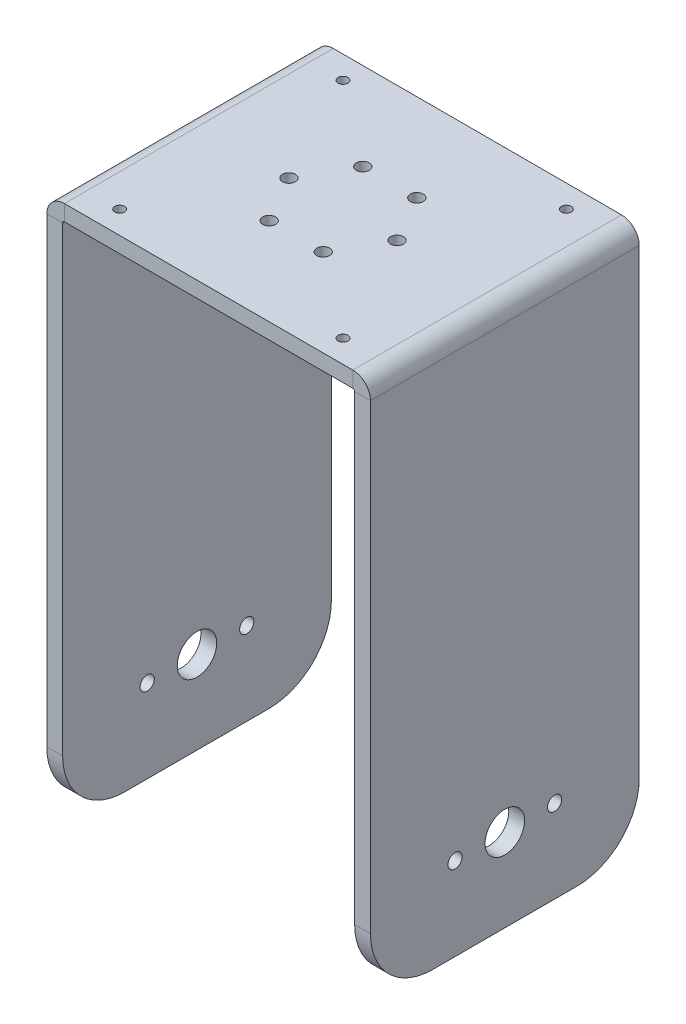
ISO-10303-21;
HEADER;
FILE_DESCRIPTION(('STEP AP214'),'2;1');
FILE_NAME('part.step','',(''),(''),'','','');
FILE_SCHEMA(('AUTOMOTIVE_DESIGN { 1 0 10303 214 1 1 1 1 }'));
ENDSEC;
DATA;
#1=APPLICATION_CONTEXT('core data for automotive mechanical design processes');
#2=APPLICATION_PROTOCOL_DEFINITION('international standard','automotive_design',2000,#1);
#3=PRODUCT_CONTEXT('',#1,'mechanical');
#4=PRODUCT('Part','Part','',(#3));
#5=PRODUCT_RELATED_PRODUCT_CATEGORY('part','',(#4));
#6=PRODUCT_DEFINITION_FORMATION('','',#4);
#7=PRODUCT_DEFINITION_CONTEXT('part definition',#1,'design');
#8=PRODUCT_DEFINITION('design','',#6,#7);
#9=PRODUCT_DEFINITION_SHAPE('','',#8);
#10=(LENGTH_UNIT() NAMED_UNIT(*) SI_UNIT(.MILLI.,.METRE.));
#11=(NAMED_UNIT(*) PLANE_ANGLE_UNIT() SI_UNIT($,.RADIAN.));
#12=(NAMED_UNIT(*) SI_UNIT($,.STERADIAN.) SOLID_ANGLE_UNIT());
#13=UNCERTAINTY_MEASURE_WITH_UNIT(LENGTH_MEASURE(1.E-05),#10,'distance_accuracy_value','');
#14=(GEOMETRIC_REPRESENTATION_CONTEXT(3) GLOBAL_UNCERTAINTY_ASSIGNED_CONTEXT((#13)) GLOBAL_UNIT_ASSIGNED_CONTEXT((#10,
#11,#12)) REPRESENTATION_CONTEXT('',''));
#15=CARTESIAN_POINT('',(0.,0.,0.));
#16=DIRECTION('',(0.,0.,1.));
#17=DIRECTION('',(1.,0.,0.));
#18=AXIS2_PLACEMENT_3D('',#15,#16,#17);
#19=CARTESIAN_POINT('',(-65.,-6.35,-53.975));
#20=DIRECTION('',(0.,0.,1.));
#21=DIRECTION('',(1.,0.,0.));
#22=AXIS2_PLACEMENT_3D('',#19,#20,#21);
#23=PLANE('',#22);
#24=DIRECTION('',(0.,1.,0.));
#25=VECTOR('',#24,1.);
#26=CARTESIAN_POINT('',(-57.9134,-6.35,-53.975));
#27=LINE('',#26,#25);
#28=CARTESIAN_POINT('',(-57.9134,-6.35,-53.975));
#29=VERTEX_POINT('',#28);
#30=CARTESIAN_POINT('',(-57.9134,0.,-53.975));
#31=VERTEX_POINT('',#30);
#32=EDGE_CURVE('E288',#29,#31,#27,.T.);
#33=ORIENTED_EDGE('',*,*,#32,.T.);
#34=DIRECTION('',(1.,0.,0.));
#35=VECTOR('',#34,1.);
#36=CARTESIAN_POINT('',(-65.,0.,-53.975));
#37=LINE('',#36,#35);
#38=CARTESIAN_POINT('',(57.9134,0.,-53.975));
#39=VERTEX_POINT('',#38);
#40=EDGE_CURVE('E371',#31,#39,#37,.T.);
#41=ORIENTED_EDGE('',*,*,#40,.T.);
#42=DIRECTION('',(0.,1.,0.));
#43=VECTOR('',#42,1.);
#44=CARTESIAN_POINT('',(57.9134,-6.35,-53.975));
#45=LINE('',#44,#43);
#46=CARTESIAN_POINT('',(57.9134,-6.35,-53.975));
#47=VERTEX_POINT('',#46);
#48=EDGE_CURVE('E362',#47,#39,#45,.T.);
#49=ORIENTED_EDGE('',*,*,#48,.F.);
#50=DIRECTION('',(1.,0.,0.));
#51=VECTOR('',#50,1.);
#52=CARTESIAN_POINT('',(-65.,-6.35,-53.975));
#53=LINE('',#52,#51);
#54=EDGE_CURVE('E370',#29,#47,#53,.T.);
#55=ORIENTED_EDGE('',*,*,#54,.F.);
#56=EDGE_LOOP('',(#33,#41,#49,#55));
#57=FACE_BOUND('',#56,.T.);
#58=ADVANCED_FACE('F97',(#57),#23,.F.);
#59=CARTESIAN_POINT('',(0.,-6.35,0.));
#60=DIRECTION('',(0.,-1.,0.));
#61=DIRECTION('',(0.,0.,-1.));
#62=AXIS2_PLACEMENT_3D('',#59,#60,#61);
#63=PLANE('',#62);
#64=CARTESIAN_POINT('',(-44.8450000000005,-6.34999999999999,44.8449999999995));
#65=DIRECTION('',(0.,-1.,0.));
#66=DIRECTION('',(0.,0.,-1.));
#67=AXIS2_PLACEMENT_3D('',#64,#65,#66);
#68=CIRCLE('',#67,1.985);
#69=CARTESIAN_POINT('',(-44.8450000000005,-6.34999999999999,42.8599999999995));
#70=VERTEX_POINT('',#69);
#71=EDGE_CURVE('E919',#70,#70,#68,.T.);
#72=ORIENTED_EDGE('',*,*,#71,.F.);
#73=EDGE_LOOP('',(#72));
#74=FACE_BOUND('',#73,.T.);
#75=CARTESIAN_POINT('',(44.8449999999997,-6.34999999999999,44.8450000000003));
#76=DIRECTION('',(0.,-1.,0.));
#77=DIRECTION('',(0.,0.,-1.));
#78=AXIS2_PLACEMENT_3D('',#75,#76,#77);
#79=CIRCLE('',#78,1.985);
#80=CARTESIAN_POINT('',(44.8449999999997,-6.34999999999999,42.8600000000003));
#81=VERTEX_POINT('',#80);
#82=EDGE_CURVE('E938',#81,#81,#79,.T.);
#83=ORIENTED_EDGE('',*,*,#82,.F.);
#84=EDGE_LOOP('',(#83));
#85=FACE_BOUND('',#84,.T.);
#86=CARTESIAN_POINT('',(44.8450000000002,-6.34999999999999,-44.8449999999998));
#87=DIRECTION('',(0.,-1.,0.));
#88=DIRECTION('',(0.,0.,-1.));
#89=AXIS2_PLACEMENT_3D('',#86,#87,#88);
#90=CIRCLE('',#89,1.985);
#91=CARTESIAN_POINT('',(44.8450000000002,-6.34999999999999,-46.8299999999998));
#92=VERTEX_POINT('',#91);
#93=EDGE_CURVE('E935',#92,#92,#90,.T.);
#94=ORIENTED_EDGE('',*,*,#93,.F.);
#95=EDGE_LOOP('',(#94));
#96=FACE_BOUND('',#95,.T.);
#97=CARTESIAN_POINT('',(-44.845,-6.34999999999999,-44.845));
#98=DIRECTION('',(0.,-1.,0.));
#99=DIRECTION('',(0.,0.,-1.));
#100=AXIS2_PLACEMENT_3D('',#97,#98,#99);
#101=CIRCLE('',#100,1.985);
#102=CARTESIAN_POINT('',(-44.845,-6.34999999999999,-46.83));
#103=VERTEX_POINT('',#102);
#104=EDGE_CURVE('E932',#103,#103,#101,.T.);
#105=ORIENTED_EDGE('',*,*,#104,.F.);
#106=EDGE_LOOP('',(#105));
#107=FACE_BOUND('',#106,.T.);
#108=CARTESIAN_POINT('',(-21.7,-6.34999999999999,0.));
#109=DIRECTION('',(0.,-1.,0.));
#110=DIRECTION('',(0.,0.,-1.));
#111=AXIS2_PLACEMENT_3D('',#108,#109,#110);
#112=CIRCLE('',#111,2.6);
#113=CARTESIAN_POINT('',(-21.7,-6.34999999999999,-2.59999999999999));
#114=VERTEX_POINT('',#113);
#115=EDGE_CURVE('E254',#114,#114,#112,.T.);
#116=ORIENTED_EDGE('',*,*,#115,.F.);
#117=EDGE_LOOP('',(#116));
#118=FACE_BOUND('',#117,.T.);
#119=CARTESIAN_POINT('',(-10.8500000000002,-6.34999999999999,18.7927512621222));
#120=DIRECTION('',(0.,-1.,0.));
#121=DIRECTION('',(0.,0.,-1.));
#122=AXIS2_PLACEMENT_3D('',#119,#120,#121);
#123=CIRCLE('',#122,2.6);
#124=CARTESIAN_POINT('',(-10.8500000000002,-6.34999999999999,16.1927512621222));
#125=VERTEX_POINT('',#124);
#126=EDGE_CURVE('E970',#125,#125,#123,.T.);
#127=ORIENTED_EDGE('',*,*,#126,.F.);
#128=EDGE_LOOP('',(#127));
#129=FACE_BOUND('',#128,.T.);
#130=CARTESIAN_POINT('',(10.8499999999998,-6.34999999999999,18.7927512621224));
#131=DIRECTION('',(0.,-1.,0.));
#132=DIRECTION('',(0.,0.,-1.));
#133=AXIS2_PLACEMENT_3D('',#130,#131,#132);
#134=CIRCLE('',#133,2.6);
#135=CARTESIAN_POINT('',(10.8499999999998,-6.34999999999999,16.1927512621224));
#136=VERTEX_POINT('',#135);
#137=EDGE_CURVE('E968',#136,#136,#134,.T.);
#138=ORIENTED_EDGE('',*,*,#137,.F.);
#139=EDGE_LOOP('',(#138));
#140=FACE_BOUND('',#139,.T.);
#141=CARTESIAN_POINT('',(21.7,-6.34999999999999,1.37652502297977E-13));
#142=DIRECTION('',(0.,-1.,0.));
#143=DIRECTION('',(0.,0.,-1.));
#144=AXIS2_PLACEMENT_3D('',#141,#142,#143);
#145=CIRCLE('',#144,2.6);
#146=CARTESIAN_POINT('',(21.7,-6.34999999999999,-2.59999999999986));
#147=VERTEX_POINT('',#146);
#148=EDGE_CURVE('E965',#147,#147,#145,.T.);
#149=ORIENTED_EDGE('',*,*,#148,.F.);
#150=EDGE_LOOP('',(#149));
#151=FACE_BOUND('',#150,.T.);
#152=CARTESIAN_POINT('',(10.8500000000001,-6.34999999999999,-18.7927512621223));
#153=DIRECTION('',(0.,-1.,0.));
#154=DIRECTION('',(0.,0.,-1.));
#155=AXIS2_PLACEMENT_3D('',#152,#153,#154);
#156=CIRCLE('',#155,2.6);
#157=CARTESIAN_POINT('',(10.8500000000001,-6.34999999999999,-21.3927512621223));
#158=VERTEX_POINT('',#157);
#159=EDGE_CURVE('E962',#158,#158,#156,.T.);
#160=ORIENTED_EDGE('',*,*,#159,.F.);
#161=EDGE_LOOP('',(#160));
#162=FACE_BOUND('',#161,.T.);
#163=CARTESIAN_POINT('',(-10.85,-6.34999999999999,-18.7927512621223));
#164=DIRECTION('',(0.,-1.,0.));
#165=DIRECTION('',(0.,0.,-1.));
#166=AXIS2_PLACEMENT_3D('',#163,#164,#165);
#167=CIRCLE('',#166,2.6);
#168=CARTESIAN_POINT('',(-10.85,-6.34999999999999,-21.3927512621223));
#169=VERTEX_POINT('',#168);
#170=EDGE_CURVE('E946',#169,#169,#167,.T.);
#171=ORIENTED_EDGE('',*,*,#170,.F.);
#172=EDGE_LOOP('',(#171));
#173=FACE_BOUND('',#172,.T.);
#174=DIRECTION('',(1.,0.,0.));
#175=VECTOR('',#174,1.);
#176=CARTESIAN_POINT('',(-65.,-6.35,53.975));
#177=LINE('',#176,#175);
#178=CARTESIAN_POINT('',(-57.9134,-6.35,53.975));
#179=VERTEX_POINT('',#178);
#180=CARTESIAN_POINT('',(57.9134,-6.35,53.975));
#181=VERTEX_POINT('',#180);
#182=EDGE_CURVE('E368',#179,#181,#177,.T.);
#183=ORIENTED_EDGE('',*,*,#182,.F.);
#184=DIRECTION('',(0.,0.,-1.));
#185=VECTOR('',#184,1.);
#186=CARTESIAN_POINT('',(-57.9134,-6.35,-53.975));
#187=LINE('',#186,#185);
#188=EDGE_CURVE('E250',#29,#179,#187,.F.);
#189=ORIENTED_EDGE('',*,*,#188,.F.);
#190=ORIENTED_EDGE('',*,*,#54,.T.);
#191=DIRECTION('',(0.,0.,1.));
#192=VECTOR('',#191,1.);
#193=CARTESIAN_POINT('',(57.9134,-6.35,53.975));
#194=LINE('',#193,#192);
#195=EDGE_CURVE('E357',#181,#47,#194,.F.);
#196=ORIENTED_EDGE('',*,*,#195,.F.);
#197=EDGE_LOOP('',(#183,#189,#190,#196));
#198=FACE_BOUND('',#197,.T.);
#199=ADVANCED_FACE('F445',(#74,#85,#96,#107,#118,#129,#140,#151,#162,#173,#198),#63,.T.);
#200=CARTESIAN_POINT('',(0.,0.,0.));
#201=DIRECTION('',(0.,-1.,0.));
#202=DIRECTION('',(0.,0.,-1.));
#203=AXIS2_PLACEMENT_3D('',#200,#201,#202);
#204=PLANE('',#203);
#205=CARTESIAN_POINT('',(-44.8450000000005,0.,44.8449999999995));
#206=DIRECTION('',(0.,1.,0.));
#207=DIRECTION('',(0.,0.,1.));
#208=AXIS2_PLACEMENT_3D('',#205,#206,#207);
#209=CIRCLE('',#208,1.985);
#210=CARTESIAN_POINT('',(-44.8450000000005,0.,46.8299999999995));
#211=VERTEX_POINT('',#210);
#212=EDGE_CURVE('E921',#211,#211,#209,.T.);
#213=ORIENTED_EDGE('',*,*,#212,.F.);
#214=EDGE_LOOP('',(#213));
#215=FACE_BOUND('',#214,.T.);
#216=CARTESIAN_POINT('',(44.8449999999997,0.,44.8450000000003));
#217=DIRECTION('',(0.,1.,0.));
#218=DIRECTION('',(0.,0.,1.));
#219=AXIS2_PLACEMENT_3D('',#216,#217,#218);
#220=CIRCLE('',#219,1.985);
#221=CARTESIAN_POINT('',(44.8449999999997,0.,46.8300000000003));
#222=VERTEX_POINT('',#221);
#223=EDGE_CURVE('E922',#222,#222,#220,.T.);
#224=ORIENTED_EDGE('',*,*,#223,.F.);
#225=EDGE_LOOP('',(#224));
#226=FACE_BOUND('',#225,.T.);
#227=CARTESIAN_POINT('',(44.8450000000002,0.,-44.8449999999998));
#228=DIRECTION('',(0.,1.,0.));
#229=DIRECTION('',(0.,0.,1.));
#230=AXIS2_PLACEMENT_3D('',#227,#228,#229);
#231=CIRCLE('',#230,1.985);
#232=CARTESIAN_POINT('',(44.8450000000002,0.,-42.8599999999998));
#233=VERTEX_POINT('',#232);
#234=EDGE_CURVE('E925',#233,#233,#231,.T.);
#235=ORIENTED_EDGE('',*,*,#234,.F.);
#236=EDGE_LOOP('',(#235));
#237=FACE_BOUND('',#236,.T.);
#238=CARTESIAN_POINT('',(-44.845,0.,-44.845));
#239=DIRECTION('',(0.,1.,0.));
#240=DIRECTION('',(0.,0.,1.));
#241=AXIS2_PLACEMENT_3D('',#238,#239,#240);
#242=CIRCLE('',#241,1.985);
#243=CARTESIAN_POINT('',(-44.845,0.,-42.86));
#244=VERTEX_POINT('',#243);
#245=EDGE_CURVE('E929',#244,#244,#242,.T.);
#246=ORIENTED_EDGE('',*,*,#245,.F.);
#247=EDGE_LOOP('',(#246));
#248=FACE_BOUND('',#247,.T.);
#249=CARTESIAN_POINT('',(-21.7,0.,0.));
#250=DIRECTION('',(0.,1.,0.));
#251=DIRECTION('',(0.,0.,1.));
#252=AXIS2_PLACEMENT_3D('',#249,#250,#251);
#253=CIRCLE('',#252,2.6);
#254=CARTESIAN_POINT('',(-21.7,0.,2.60000000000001));
#255=VERTEX_POINT('',#254);
#256=EDGE_CURVE('E943',#255,#255,#253,.T.);
#257=ORIENTED_EDGE('',*,*,#256,.F.);
#258=EDGE_LOOP('',(#257));
#259=FACE_BOUND('',#258,.T.);
#260=CARTESIAN_POINT('',(-10.8500000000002,0.,18.7927512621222));
#261=DIRECTION('',(0.,1.,0.));
#262=DIRECTION('',(0.,0.,1.));
#263=AXIS2_PLACEMENT_3D('',#260,#261,#262);
#264=CIRCLE('',#263,2.6);
#265=CARTESIAN_POINT('',(-10.8500000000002,0.,21.3927512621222));
#266=VERTEX_POINT('',#265);
#267=EDGE_CURVE('E942',#266,#266,#264,.T.);
#268=ORIENTED_EDGE('',*,*,#267,.F.);
#269=EDGE_LOOP('',(#268));
#270=FACE_BOUND('',#269,.T.);
#271=CARTESIAN_POINT('',(10.8499999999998,0.,18.7927512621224));
#272=DIRECTION('',(0.,1.,0.));
#273=DIRECTION('',(0.,0.,1.));
#274=AXIS2_PLACEMENT_3D('',#271,#272,#273);
#275=CIRCLE('',#274,2.6);
#276=CARTESIAN_POINT('',(10.8499999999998,0.,21.3927512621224));
#277=VERTEX_POINT('',#276);
#278=EDGE_CURVE('E950',#277,#277,#275,.T.);
#279=ORIENTED_EDGE('',*,*,#278,.F.);
#280=EDGE_LOOP('',(#279));
#281=FACE_BOUND('',#280,.T.);
#282=CARTESIAN_POINT('',(21.7,0.,1.37652502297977E-13));
#283=DIRECTION('',(0.,1.,0.));
#284=DIRECTION('',(0.,0.,1.));
#285=AXIS2_PLACEMENT_3D('',#282,#283,#284);
#286=CIRCLE('',#285,2.6);
#287=CARTESIAN_POINT('',(21.7,0.,2.60000000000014));
#288=VERTEX_POINT('',#287);
#289=EDGE_CURVE('E956',#288,#288,#286,.T.);
#290=ORIENTED_EDGE('',*,*,#289,.F.);
#291=EDGE_LOOP('',(#290));
#292=FACE_BOUND('',#291,.T.);
#293=CARTESIAN_POINT('',(10.8500000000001,0.,-18.7927512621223));
#294=DIRECTION('',(0.,1.,0.));
#295=DIRECTION('',(0.,0.,1.));
#296=AXIS2_PLACEMENT_3D('',#293,#294,#295);
#297=CIRCLE('',#296,2.6);
#298=CARTESIAN_POINT('',(10.8500000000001,0.,-16.1927512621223));
#299=VERTEX_POINT('',#298);
#300=EDGE_CURVE('E953',#299,#299,#297,.T.);
#301=ORIENTED_EDGE('',*,*,#300,.F.);
#302=EDGE_LOOP('',(#301));
#303=FACE_BOUND('',#302,.T.);
#304=CARTESIAN_POINT('',(-10.85,0.,-18.7927512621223));
#305=DIRECTION('',(0.,1.,0.));
#306=DIRECTION('',(0.,0.,1.));
#307=AXIS2_PLACEMENT_3D('',#304,#305,#306);
#308=CIRCLE('',#307,2.6);
#309=CARTESIAN_POINT('',(-10.85,0.,-16.1927512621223));
#310=VERTEX_POINT('',#309);
#311=EDGE_CURVE('E947',#310,#310,#308,.T.);
#312=ORIENTED_EDGE('',*,*,#311,.F.);
#313=EDGE_LOOP('',(#312));
#314=FACE_BOUND('',#313,.T.);
#315=DIRECTION('',(0.,0.,-1.));
#316=VECTOR('',#315,1.);
#317=CARTESIAN_POINT('',(-57.9134,0.,-53.975));
#318=LINE('',#317,#316);
#319=CARTESIAN_POINT('',(-57.9134,0.,53.975));
#320=VERTEX_POINT('',#319);
#321=EDGE_CURVE('E218',#31,#320,#318,.F.);
#322=ORIENTED_EDGE('',*,*,#321,.T.);
#323=DIRECTION('',(1.,0.,0.));
#324=VECTOR('',#323,1.);
#325=CARTESIAN_POINT('',(-65.,0.,53.975));
#326=LINE('',#325,#324);
#327=CARTESIAN_POINT('',(57.9134,0.,53.975));
#328=VERTEX_POINT('',#327);
#329=EDGE_CURVE('E365',#320,#328,#326,.T.);
#330=ORIENTED_EDGE('',*,*,#329,.T.);
#331=DIRECTION('',(0.,0.,1.));
#332=VECTOR('',#331,1.);
#333=CARTESIAN_POINT('',(57.9134,0.,53.975));
#334=LINE('',#333,#332);
#335=EDGE_CURVE('E344',#328,#39,#334,.F.);
#336=ORIENTED_EDGE('',*,*,#335,.T.);
#337=ORIENTED_EDGE('',*,*,#40,.F.);
#338=EDGE_LOOP('',(#322,#330,#336,#337));
#339=FACE_BOUND('',#338,.T.);
#340=ADVANCED_FACE('F450',(#215,#226,#237,#248,#259,#270,#281,#292,#303,#314,#339),#204,.F.);
#341=CARTESIAN_POINT('',(-65.,-6.35,53.975));
#342=DIRECTION('',(0.,0.,1.));
#343=DIRECTION('',(1.,0.,0.));
#344=AXIS2_PLACEMENT_3D('',#341,#342,#343);
#345=PLANE('',#344);
#346=DIRECTION('',(0.,1.,0.));
#347=VECTOR('',#346,1.);
#348=CARTESIAN_POINT('',(-57.9134,-6.35,53.975));
#349=LINE('',#348,#347);
#350=EDGE_CURVE('E294',#179,#320,#349,.T.);
#351=ORIENTED_EDGE('',*,*,#350,.F.);
#352=ORIENTED_EDGE('',*,*,#182,.T.);
#353=DIRECTION('',(0.,1.,0.));
#354=VECTOR('',#353,1.);
#355=CARTESIAN_POINT('',(57.9134,-6.35,53.975));
#356=LINE('',#355,#354);
#357=EDGE_CURVE('E351',#181,#328,#356,.T.);
#358=ORIENTED_EDGE('',*,*,#357,.T.);
#359=ORIENTED_EDGE('',*,*,#329,.F.);
#360=EDGE_LOOP('',(#351,#352,#358,#359));
#361=FACE_BOUND('',#360,.T.);
#362=ADVANCED_FACE('F448',(#361),#345,.T.);
#363=CARTESIAN_POINT('',(57.9134,-7.0866,-53.975));
#364=DIRECTION('',(0.,0.,-1.));
#365=DIRECTION('',(-1.,0.,0.));
#366=AXIS2_PLACEMENT_3D('',#363,#364,#365);
#367=PLANE('',#366);
#368=DIRECTION('',(1.,0.,0.));
#369=VECTOR('',#368,1.);
#370=CARTESIAN_POINT('',(65.,-7.08659999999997,-53.975));
#371=LINE('',#370,#369);
#372=CARTESIAN_POINT('',(58.65,-7.0866,-53.975));
#373=VERTEX_POINT('',#372);
#374=CARTESIAN_POINT('',(65.,-7.08659999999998,-53.9749999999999));
#375=VERTEX_POINT('',#374);
#376=EDGE_CURVE('E297',#373,#375,#371,.T.);
#377=ORIENTED_EDGE('',*,*,#376,.F.);
#378=CARTESIAN_POINT('',(57.9134,-7.0866,-53.975));
#379=DIRECTION('',(0.,0.,1.));
#380=DIRECTION('',(1.,0.,0.));
#381=AXIS2_PLACEMENT_3D('',#378,#379,#380);
#382=CIRCLE('',#381,0.736599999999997);
#383=EDGE_CURVE('E354',#47,#373,#382,.F.);
#384=ORIENTED_EDGE('',*,*,#383,.F.);
#385=ORIENTED_EDGE('',*,*,#48,.T.);
#386=CARTESIAN_POINT('',(57.9134,-7.0866,-53.9749999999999));
#387=DIRECTION('',(0.,0.,1.));
#388=DIRECTION('',(1.,0.,0.));
#389=AXIS2_PLACEMENT_3D('',#386,#387,#388);
#390=CIRCLE('',#389,7.0866);
#391=EDGE_CURVE('E347',#39,#375,#390,.F.);
#392=ORIENTED_EDGE('',*,*,#391,.T.);
#393=EDGE_LOOP('',(#377,#384,#385,#392));
#394=FACE_BOUND('',#393,.T.);
#395=ADVANCED_FACE('F434',(#394),#367,.T.);
#396=CARTESIAN_POINT('',(57.9134,-7.0866,53.975));
#397=DIRECTION('',(0.,0.,-1.));
#398=DIRECTION('',(-1.,0.,0.));
#399=AXIS2_PLACEMENT_3D('',#396,#397,#398);
#400=PLANE('',#399);
#401=CARTESIAN_POINT('',(57.9134,-7.0866,53.975));
#402=DIRECTION('',(0.,0.,1.));
#403=DIRECTION('',(1.,0.,0.));
#404=AXIS2_PLACEMENT_3D('',#401,#402,#403);
#405=CIRCLE('',#404,0.736599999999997);
#406=CARTESIAN_POINT('',(58.65,-7.0866,53.975));
#407=VERTEX_POINT('',#406);
#408=EDGE_CURVE('E301',#407,#181,#405,.T.);
#409=ORIENTED_EDGE('',*,*,#408,.F.);
#410=DIRECTION('',(1.,0.,0.));
#411=VECTOR('',#410,1.);
#412=CARTESIAN_POINT('',(58.65,-7.0866,53.975));
#413=LINE('',#412,#411);
#414=CARTESIAN_POINT('',(65.,-7.08659999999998,53.975));
#415=VERTEX_POINT('',#414);
#416=EDGE_CURVE('E336',#407,#415,#413,.T.);
#417=ORIENTED_EDGE('',*,*,#416,.T.);
#418=CARTESIAN_POINT('',(57.9134,-7.0866,53.975));
#419=DIRECTION('',(0.,0.,1.));
#420=DIRECTION('',(1.,0.,0.));
#421=AXIS2_PLACEMENT_3D('',#418,#419,#420);
#422=CIRCLE('',#421,7.0866);
#423=EDGE_CURVE('E348',#415,#328,#422,.T.);
#424=ORIENTED_EDGE('',*,*,#423,.T.);
#425=ORIENTED_EDGE('',*,*,#357,.F.);
#426=EDGE_LOOP('',(#409,#417,#424,#425));
#427=FACE_BOUND('',#426,.T.);
#428=ADVANCED_FACE('F427',(#427),#400,.F.);
#429=CARTESIAN_POINT('',(57.9134,-7.0866,53.975));
#430=DIRECTION('',(0.,0.,1.));
#431=DIRECTION('',(1.,0.,0.));
#432=AXIS2_PLACEMENT_3D('',#429,#430,#431);
#433=CYLINDRICAL_SURFACE('',#432,7.0866);
#434=ORIENTED_EDGE('',*,*,#335,.F.);
#435=ORIENTED_EDGE('',*,*,#423,.F.);
#436=DIRECTION('',(0.,0.,1.));
#437=VECTOR('',#436,1.);
#438=CARTESIAN_POINT('',(65.,-7.08659999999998,0.));
#439=LINE('',#438,#437);
#440=EDGE_CURVE('E333',#375,#415,#439,.T.);
#441=ORIENTED_EDGE('',*,*,#440,.F.);
#442=ORIENTED_EDGE('',*,*,#391,.F.);
#443=EDGE_LOOP('',(#434,#435,#441,#442));
#444=FACE_BOUND('',#443,.T.);
#445=ADVANCED_FACE('F432',(#444),#433,.T.);
#446=CARTESIAN_POINT('',(57.9134,-7.0866,53.975));
#447=DIRECTION('',(0.,0.,1.));
#448=DIRECTION('',(1.,0.,0.));
#449=AXIS2_PLACEMENT_3D('',#446,#447,#448);
#450=CYLINDRICAL_SURFACE('',#449,0.736599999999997);
#451=ORIENTED_EDGE('',*,*,#195,.T.);
#452=ORIENTED_EDGE('',*,*,#383,.T.);
#453=DIRECTION('',(0.,0.,-1.));
#454=VECTOR('',#453,1.);
#455=CARTESIAN_POINT('',(58.65,-7.0866,-53.975));
#456=LINE('',#455,#454);
#457=EDGE_CURVE('E339',#373,#407,#456,.F.);
#458=ORIENTED_EDGE('',*,*,#457,.T.);
#459=ORIENTED_EDGE('',*,*,#408,.T.);
#460=EDGE_LOOP('',(#451,#452,#458,#459));
#461=FACE_BOUND('',#460,.T.);
#462=ADVANCED_FACE('F442',(#461),#450,.F.);
#463=CARTESIAN_POINT('',(65.,-6.34999999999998,53.975));
#464=DIRECTION('',(0.,0.,1.));
#465=DIRECTION('',(1.,0.,0.));
#466=AXIS2_PLACEMENT_3D('',#463,#464,#465);
#467=PLANE('',#466);
#468=DIRECTION('',(0.,-1.,0.));
#469=VECTOR('',#468,1.);
#470=CARTESIAN_POINT('',(58.65,2.26435280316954E-13,53.975));
#471=LINE('',#470,#469);
#472=CARTESIAN_POINT('',(58.6500000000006,-192.4875,53.975));
#473=VERTEX_POINT('',#472);
#474=EDGE_CURVE('E307',#473,#407,#471,.F.);
#475=ORIENTED_EDGE('',*,*,#474,.F.);
#476=DIRECTION('',(-1.,0.,0.));
#477=VECTOR('',#476,1.);
#478=CARTESIAN_POINT('',(65.0000000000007,-192.4875,53.975));
#479=LINE('',#478,#477);
#480=CARTESIAN_POINT('',(65.0000000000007,-192.4875,53.975));
#481=VERTEX_POINT('',#480);
#482=EDGE_CURVE('E13',#473,#481,#479,.F.);
#483=ORIENTED_EDGE('',*,*,#482,.T.);
#484=DIRECTION('',(0.,1.,0.));
#485=VECTOR('',#484,1.);
#486=CARTESIAN_POINT('',(65.,-6.34999999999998,53.975));
#487=LINE('',#486,#485);
#488=EDGE_CURVE('E299',#481,#415,#487,.T.);
#489=ORIENTED_EDGE('',*,*,#488,.T.);
#490=ORIENTED_EDGE('',*,*,#416,.F.);
#491=EDGE_LOOP('',(#475,#483,#489,#490));
#492=FACE_BOUND('',#491,.T.);
#493=ADVANCED_FACE('F423',(#492),#467,.T.);
#494=CARTESIAN_POINT('',(65.0000000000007,-217.4875,-53.975));
#495=DIRECTION('',(0.,0.,-1.));
#496=DIRECTION('',(-1.,0.,0.));
#497=AXIS2_PLACEMENT_3D('',#494,#495,#496);
#498=PLANE('',#497);
#499=DIRECTION('',(0.,-1.,0.));
#500=VECTOR('',#499,1.);
#501=CARTESIAN_POINT('',(65.0000000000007,-217.4875,-53.975));
#502=LINE('',#501,#500);
#503=CARTESIAN_POINT('',(65.0000000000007,-192.4875,-53.975));
#504=VERTEX_POINT('',#503);
#505=EDGE_CURVE('E304',#375,#504,#502,.T.);
#506=ORIENTED_EDGE('',*,*,#505,.T.);
#507=DIRECTION('',(-1.,0.,0.));
#508=VECTOR('',#507,1.);
#509=CARTESIAN_POINT('',(65.0000000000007,-192.4875,-53.975));
#510=LINE('',#509,#508);
#511=CARTESIAN_POINT('',(58.6500000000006,-192.4875,-53.975));
#512=VERTEX_POINT('',#511);
#513=EDGE_CURVE('E392',#504,#512,#510,.T.);
#514=ORIENTED_EDGE('',*,*,#513,.T.);
#515=DIRECTION('',(0.,1.,0.));
#516=VECTOR('',#515,1.);
#517=CARTESIAN_POINT('',(58.65,2.26435280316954E-13,-53.975));
#518=LINE('',#517,#516);
#519=EDGE_CURVE('E312',#373,#512,#518,.F.);
#520=ORIENTED_EDGE('',*,*,#519,.F.);
#521=ORIENTED_EDGE('',*,*,#376,.T.);
#522=EDGE_LOOP('',(#506,#514,#520,#521));
#523=FACE_BOUND('',#522,.T.);
#524=ADVANCED_FACE('F411',(#523),#498,.T.);
#525=CARTESIAN_POINT('',(65.,2.48606186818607E-13,0.));
#526=DIRECTION('',(1.,0.,0.));
#527=DIRECTION('',(0.,1.,0.));
#528=AXIS2_PLACEMENT_3D('',#525,#526,#527);
#529=PLANE('',#528);
#530=CARTESIAN_POINT('',(65.0000000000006,-184.15,-20.));
#531=DIRECTION('',(1.,0.,0.));
#532=DIRECTION('',(0.,1.,0.));
#533=AXIS2_PLACEMENT_3D('',#530,#531,#532);
#534=CIRCLE('',#533,2.85523560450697);
#535=CARTESIAN_POINT('',(65.0000000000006,-181.294764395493,-20.));
#536=VERTEX_POINT('',#535);
#537=EDGE_CURVE('E327',#536,#536,#534,.F.);
#538=ORIENTED_EDGE('',*,*,#537,.T.);
#539=EDGE_LOOP('',(#538));
#540=FACE_BOUND('',#539,.T.);
#541=CARTESIAN_POINT('',(65.0000000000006,-184.15,20.));
#542=DIRECTION('',(1.,0.,0.));
#543=DIRECTION('',(0.,1.,0.));
#544=AXIS2_PLACEMENT_3D('',#541,#542,#543);
#545=CIRCLE('',#544,2.85523560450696);
#546=CARTESIAN_POINT('',(65.0000000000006,-181.294764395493,20.));
#547=VERTEX_POINT('',#546);
#548=EDGE_CURVE('E321',#547,#547,#545,.F.);
#549=ORIENTED_EDGE('',*,*,#548,.T.);
#550=EDGE_LOOP('',(#549));
#551=FACE_BOUND('',#550,.T.);
#552=CARTESIAN_POINT('',(65.0000000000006,-184.15,0.));
#553=DIRECTION('',(1.,0.,0.));
#554=DIRECTION('',(0.,1.,0.));
#555=AXIS2_PLACEMENT_3D('',#552,#553,#554);
#556=CIRCLE('',#555,7.93749999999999);
#557=CARTESIAN_POINT('',(65.0000000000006,-176.2125,0.));
#558=VERTEX_POINT('',#557);
#559=EDGE_CURVE('E315',#558,#558,#556,.F.);
#560=ORIENTED_EDGE('',*,*,#559,.T.);
#561=EDGE_LOOP('',(#560));
#562=FACE_BOUND('',#561,.T.);
#563=DIRECTION('',(0.,0.,1.));
#564=VECTOR('',#563,1.);
#565=CARTESIAN_POINT('',(65.0000000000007,-217.4875,53.975));
#566=LINE('',#565,#564);
#567=CARTESIAN_POINT('',(65.0000000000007,-217.4875,-28.975));
#568=VERTEX_POINT('',#567);
#569=CARTESIAN_POINT('',(65.0000000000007,-217.4875,28.975));
#570=VERTEX_POINT('',#569);
#571=EDGE_CURVE('E302',#568,#570,#566,.T.);
#572=ORIENTED_EDGE('',*,*,#571,.F.);
#573=CARTESIAN_POINT('',(65.0000000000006,-192.4875,-28.975));
#574=DIRECTION('',(1.,0.,0.));
#575=DIRECTION('',(0.,1.,0.));
#576=AXIS2_PLACEMENT_3D('',#573,#574,#575);
#577=CIRCLE('',#576,25.);
#578=EDGE_CURVE('E105',#568,#504,#577,.T.);
#579=ORIENTED_EDGE('',*,*,#578,.T.);
#580=ORIENTED_EDGE('',*,*,#505,.F.);
#581=ORIENTED_EDGE('',*,*,#440,.T.);
#582=ORIENTED_EDGE('',*,*,#488,.F.);
#583=CARTESIAN_POINT('',(65.0000000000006,-192.4875,28.975));
#584=DIRECTION('',(1.,0.,0.));
#585=DIRECTION('',(0.,1.,0.));
#586=AXIS2_PLACEMENT_3D('',#583,#584,#585);
#587=CIRCLE('',#586,25.);
#588=EDGE_CURVE('E117',#481,#570,#587,.T.);
#589=ORIENTED_EDGE('',*,*,#588,.T.);
#590=EDGE_LOOP('',(#572,#579,#580,#581,#582,#589));
#591=FACE_BOUND('',#590,.T.);
#592=ADVANCED_FACE('F406',(#540,#551,#562,#591),#529,.T.);
#593=CARTESIAN_POINT('',(58.65,2.26435280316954E-13,0.));
#594=DIRECTION('',(1.,0.,0.));
#595=DIRECTION('',(0.,1.,0.));
#596=AXIS2_PLACEMENT_3D('',#593,#594,#595);
#597=PLANE('',#596);
#598=CARTESIAN_POINT('',(58.6500000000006,-184.15,0.));
#599=DIRECTION('',(1.,0.,0.));
#600=DIRECTION('',(0.,1.,0.));
#601=AXIS2_PLACEMENT_3D('',#598,#599,#600);
#602=CIRCLE('',#601,7.93749999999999);
#603=CARTESIAN_POINT('',(58.6500000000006,-176.2125,0.));
#604=VERTEX_POINT('',#603);
#605=EDGE_CURVE('E318',#604,#604,#602,.F.);
#606=ORIENTED_EDGE('',*,*,#605,.F.);
#607=EDGE_LOOP('',(#606));
#608=FACE_BOUND('',#607,.T.);
#609=CARTESIAN_POINT('',(58.6500000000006,-184.15,20.));
#610=DIRECTION('',(1.,0.,0.));
#611=DIRECTION('',(0.,1.,0.));
#612=AXIS2_PLACEMENT_3D('',#609,#610,#611);
#613=CIRCLE('',#612,2.85523560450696);
#614=CARTESIAN_POINT('',(58.6500000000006,-181.294764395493,20.));
#615=VERTEX_POINT('',#614);
#616=EDGE_CURVE('E324',#615,#615,#613,.F.);
#617=ORIENTED_EDGE('',*,*,#616,.F.);
#618=EDGE_LOOP('',(#617));
#619=FACE_BOUND('',#618,.T.);
#620=CARTESIAN_POINT('',(58.6500000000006,-184.15,-20.));
#621=DIRECTION('',(1.,0.,0.));
#622=DIRECTION('',(0.,1.,0.));
#623=AXIS2_PLACEMENT_3D('',#620,#621,#622);
#624=CIRCLE('',#623,2.85523560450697);
#625=CARTESIAN_POINT('',(58.6500000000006,-181.294764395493,-20.));
#626=VERTEX_POINT('',#625);
#627=EDGE_CURVE('E330',#626,#626,#624,.F.);
#628=ORIENTED_EDGE('',*,*,#627,.F.);
#629=EDGE_LOOP('',(#628));
#630=FACE_BOUND('',#629,.T.);
#631=ORIENTED_EDGE('',*,*,#519,.T.);
#632=CARTESIAN_POINT('',(58.6500000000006,-192.4875,-28.975));
#633=DIRECTION('',(1.,0.,0.));
#634=DIRECTION('',(0.,1.,0.));
#635=AXIS2_PLACEMENT_3D('',#632,#633,#634);
#636=CIRCLE('',#635,25.);
#637=CARTESIAN_POINT('',(58.6500000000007,-217.4875,-28.975));
#638=VERTEX_POINT('',#637);
#639=EDGE_CURVE('E397',#512,#638,#636,.F.);
#640=ORIENTED_EDGE('',*,*,#639,.T.);
#641=DIRECTION('',(0.,0.,-1.));
#642=VECTOR('',#641,1.);
#643=CARTESIAN_POINT('',(58.6500000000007,-217.4875,0.));
#644=LINE('',#643,#642);
#645=CARTESIAN_POINT('',(58.6500000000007,-217.4875,28.975));
#646=VERTEX_POINT('',#645);
#647=EDGE_CURVE('E309',#638,#646,#644,.F.);
#648=ORIENTED_EDGE('',*,*,#647,.T.);
#649=CARTESIAN_POINT('',(58.6500000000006,-192.4875,28.975));
#650=DIRECTION('',(1.,0.,0.));
#651=DIRECTION('',(0.,1.,0.));
#652=AXIS2_PLACEMENT_3D('',#649,#650,#651);
#653=CIRCLE('',#652,25.);
#654=EDGE_CURVE('E395',#646,#473,#653,.F.);
#655=ORIENTED_EDGE('',*,*,#654,.T.);
#656=ORIENTED_EDGE('',*,*,#474,.T.);
#657=ORIENTED_EDGE('',*,*,#457,.F.);
#658=EDGE_LOOP('',(#631,#640,#648,#655,#656,#657));
#659=FACE_BOUND('',#658,.T.);
#660=ADVANCED_FACE('F416',(#608,#619,#630,#659),#597,.F.);
#661=CARTESIAN_POINT('',(65.0000000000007,-217.4875,53.975));
#662=DIRECTION('',(0.,-1.,0.));
#663=DIRECTION('',(1.,0.,0.));
#664=AXIS2_PLACEMENT_3D('',#661,#662,#663);
#665=PLANE('',#664);
#666=ORIENTED_EDGE('',*,*,#647,.F.);
#667=DIRECTION('',(-1.,0.,0.));
#668=VECTOR('',#667,1.);
#669=CARTESIAN_POINT('',(65.0000000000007,-217.4875,-28.975));
#670=LINE('',#669,#668);
#671=EDGE_CURVE('E402',#638,#568,#670,.F.);
#672=ORIENTED_EDGE('',*,*,#671,.T.);
#673=ORIENTED_EDGE('',*,*,#571,.T.);
#674=DIRECTION('',(-1.,0.,0.));
#675=VECTOR('',#674,1.);
#676=CARTESIAN_POINT('',(65.0000000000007,-217.4875,28.975));
#677=LINE('',#676,#675);
#678=EDGE_CURVE('E399',#570,#646,#677,.T.);
#679=ORIENTED_EDGE('',*,*,#678,.T.);
#680=EDGE_LOOP('',(#666,#672,#673,#679));
#681=FACE_BOUND('',#680,.T.);
#682=ADVANCED_FACE('F419',(#681),#665,.T.);
#683=CARTESIAN_POINT('',(65.0000000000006,-184.15,0.));
#684=DIRECTION('',(-1.,0.,0.));
#685=DIRECTION('',(0.,-1.,0.));
#686=AXIS2_PLACEMENT_3D('',#683,#684,#685);
#687=CYLINDRICAL_SURFACE('',#686,7.93749999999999);
#688=ORIENTED_EDGE('',*,*,#559,.F.);
#689=EDGE_LOOP('',(#688));
#690=FACE_BOUND('',#689,.T.);
#691=ORIENTED_EDGE('',*,*,#605,.T.);
#692=EDGE_LOOP('',(#691));
#693=FACE_BOUND('',#692,.T.);
#694=ADVANCED_FACE('F554',(#690,#693),#687,.F.);
#695=CARTESIAN_POINT('',(65.0000000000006,-184.15,20.));
#696=DIRECTION('',(-1.,0.,0.));
#697=DIRECTION('',(0.,-1.,0.));
#698=AXIS2_PLACEMENT_3D('',#695,#696,#697);
#699=CYLINDRICAL_SURFACE('',#698,2.85523560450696);
#700=ORIENTED_EDGE('',*,*,#548,.F.);
#701=EDGE_LOOP('',(#700));
#702=FACE_BOUND('',#701,.T.);
#703=ORIENTED_EDGE('',*,*,#616,.T.);
#704=EDGE_LOOP('',(#703));
#705=FACE_BOUND('',#704,.T.);
#706=ADVANCED_FACE('F550',(#702,#705),#699,.F.);
#707=CARTESIAN_POINT('',(65.0000000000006,-184.15,-20.));
#708=DIRECTION('',(-1.,0.,0.));
#709=DIRECTION('',(0.,-1.,0.));
#710=AXIS2_PLACEMENT_3D('',#707,#708,#709);
#711=CYLINDRICAL_SURFACE('',#710,2.85523560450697);
#712=ORIENTED_EDGE('',*,*,#537,.F.);
#713=EDGE_LOOP('',(#712));
#714=FACE_BOUND('',#713,.T.);
#715=ORIENTED_EDGE('',*,*,#627,.T.);
#716=EDGE_LOOP('',(#715));
#717=FACE_BOUND('',#716,.T.);
#718=ADVANCED_FACE('F545',(#714,#717),#711,.F.);
#719=CARTESIAN_POINT('',(-57.9134,-7.0866,53.975));
#720=DIRECTION('',(0.,0.,1.));
#721=DIRECTION('',(1.,0.,0.));
#722=AXIS2_PLACEMENT_3D('',#719,#720,#721);
#723=PLANE('',#722);
#724=DIRECTION('',(1.,0.,0.));
#725=VECTOR('',#724,1.);
#726=CARTESIAN_POINT('',(-65.,-7.08659999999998,53.975));
#727=LINE('',#726,#725);
#728=CARTESIAN_POINT('',(-58.65,-7.0866,53.975));
#729=VERTEX_POINT('',#728);
#730=CARTESIAN_POINT('',(-65.,-7.08659999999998,53.975));
#731=VERTEX_POINT('',#730);
#732=EDGE_CURVE('E283',#729,#731,#727,.F.);
#733=ORIENTED_EDGE('',*,*,#732,.F.);
#734=CARTESIAN_POINT('',(-57.9134,-7.0866,53.975));
#735=DIRECTION('',(0.,0.,-1.));
#736=DIRECTION('',(-1.,0.,0.));
#737=AXIS2_PLACEMENT_3D('',#734,#735,#736);
#738=CIRCLE('',#737,0.736600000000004);
#739=EDGE_CURVE('E221',#179,#729,#738,.F.);
#740=ORIENTED_EDGE('',*,*,#739,.F.);
#741=ORIENTED_EDGE('',*,*,#350,.T.);
#742=CARTESIAN_POINT('',(-57.9134,-7.0866,53.975));
#743=DIRECTION('',(0.,0.,-1.));
#744=DIRECTION('',(-1.,0.,0.));
#745=AXIS2_PLACEMENT_3D('',#742,#743,#744);
#746=CIRCLE('',#745,7.0866);
#747=EDGE_CURVE('E287',#320,#731,#746,.F.);
#748=ORIENTED_EDGE('',*,*,#747,.T.);
#749=EDGE_LOOP('',(#733,#740,#741,#748));
#750=FACE_BOUND('',#749,.T.);
#751=ADVANCED_FACE('F542',(#750),#723,.T.);
#752=CARTESIAN_POINT('',(-57.9134,-7.0866,-53.975));
#753=DIRECTION('',(0.,0.,1.));
#754=DIRECTION('',(1.,0.,0.));
#755=AXIS2_PLACEMENT_3D('',#752,#753,#754);
#756=PLANE('',#755);
#757=CARTESIAN_POINT('',(-57.9134,-7.0866,-53.975));
#758=DIRECTION('',(0.,0.,-1.));
#759=DIRECTION('',(-1.,0.,0.));
#760=AXIS2_PLACEMENT_3D('',#757,#758,#759);
#761=CIRCLE('',#760,0.736600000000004);
#762=CARTESIAN_POINT('',(-58.65,-7.0866,-53.975));
#763=VERTEX_POINT('',#762);
#764=EDGE_CURVE('E228',#763,#29,#761,.T.);
#765=ORIENTED_EDGE('',*,*,#764,.F.);
#766=DIRECTION('',(1.,0.,0.));
#767=VECTOR('',#766,1.);
#768=CARTESIAN_POINT('',(-58.65,-7.0866,-53.975));
#769=LINE('',#768,#767);
#770=CARTESIAN_POINT('',(-65.,-7.08659999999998,-53.975));
#771=VERTEX_POINT('',#770);
#772=EDGE_CURVE('E225',#763,#771,#769,.F.);
#773=ORIENTED_EDGE('',*,*,#772,.T.);
#774=CARTESIAN_POINT('',(-57.9134,-7.0866,-53.975));
#775=DIRECTION('',(0.,0.,-1.));
#776=DIRECTION('',(-1.,0.,0.));
#777=AXIS2_PLACEMENT_3D('',#774,#775,#776);
#778=CIRCLE('',#777,7.0866);
#779=EDGE_CURVE('E211',#771,#31,#778,.T.);
#780=ORIENTED_EDGE('',*,*,#779,.T.);
#781=ORIENTED_EDGE('',*,*,#32,.F.);
#782=EDGE_LOOP('',(#765,#773,#780,#781));
#783=FACE_BOUND('',#782,.T.);
#784=ADVANCED_FACE('F226',(#783),#756,.F.);
#785=CARTESIAN_POINT('',(-57.9134,-7.0866,-53.975));
#786=DIRECTION('',(0.,0.,-1.));
#787=DIRECTION('',(-1.,0.,0.));
#788=AXIS2_PLACEMENT_3D('',#785,#786,#787);
#789=CYLINDRICAL_SURFACE('',#788,7.0866);
#790=ORIENTED_EDGE('',*,*,#321,.F.);
#791=ORIENTED_EDGE('',*,*,#779,.F.);
#792=DIRECTION('',(0.,0.,-1.));
#793=VECTOR('',#792,1.);
#794=CARTESIAN_POINT('',(-65.,-7.08659999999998,0.));
#795=LINE('',#794,#793);
#796=EDGE_CURVE('E216',#731,#771,#795,.T.);
#797=ORIENTED_EDGE('',*,*,#796,.F.);
#798=ORIENTED_EDGE('',*,*,#747,.F.);
#799=EDGE_LOOP('',(#790,#791,#797,#798));
#800=FACE_BOUND('',#799,.T.);
#801=ADVANCED_FACE('F213',(#800),#789,.T.);
#802=CARTESIAN_POINT('',(-57.9134,-7.0866,-53.975));
#803=DIRECTION('',(0.,0.,-1.));
#804=DIRECTION('',(-1.,0.,0.));
#805=AXIS2_PLACEMENT_3D('',#802,#803,#804);
#806=CYLINDRICAL_SURFACE('',#805,0.736600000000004);
#807=ORIENTED_EDGE('',*,*,#188,.T.);
#808=ORIENTED_EDGE('',*,*,#739,.T.);
#809=DIRECTION('',(0.,0.,1.));
#810=VECTOR('',#809,1.);
#811=CARTESIAN_POINT('',(-58.65,-7.0866,53.975));
#812=LINE('',#811,#810);
#813=EDGE_CURVE('E233',#729,#763,#812,.F.);
#814=ORIENTED_EDGE('',*,*,#813,.T.);
#815=ORIENTED_EDGE('',*,*,#764,.T.);
#816=EDGE_LOOP('',(#807,#808,#814,#815));
#817=FACE_BOUND('',#816,.T.);
#818=ADVANCED_FACE('F523',(#817),#806,.F.);
#819=CARTESIAN_POINT('',(-65.,2.48606186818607E-13,0.));
#820=DIRECTION('',(-1.,0.,0.));
#821=DIRECTION('',(0.,1.,0.));
#822=AXIS2_PLACEMENT_3D('',#819,#820,#821);
#823=PLANE('',#822);
#824=CARTESIAN_POINT('',(-65.0000000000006,-184.15,20.));
#825=DIRECTION('',(-1.,0.,0.));
#826=DIRECTION('',(0.,-1.,0.));
#827=AXIS2_PLACEMENT_3D('',#824,#825,#826);
#828=CIRCLE('',#827,2.85523560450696);
#829=CARTESIAN_POINT('',(-65.0000000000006,-187.005235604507,20.));
#830=VERTEX_POINT('',#829);
#831=EDGE_CURVE('E271',#830,#830,#828,.T.);
#832=ORIENTED_EDGE('',*,*,#831,.F.);
#833=EDGE_LOOP('',(#832));
#834=FACE_BOUND('',#833,.T.);
#835=CARTESIAN_POINT('',(-65.0000000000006,-184.15,0.));
#836=DIRECTION('',(-1.,0.,0.));
#837=DIRECTION('',(0.,-1.,0.));
#838=AXIS2_PLACEMENT_3D('',#835,#836,#837);
#839=CIRCLE('',#838,7.93749999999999);
#840=CARTESIAN_POINT('',(-65.0000000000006,-192.0875,0.));
#841=VERTEX_POINT('',#840);
#842=EDGE_CURVE('E265',#841,#841,#839,.T.);
#843=ORIENTED_EDGE('',*,*,#842,.F.);
#844=EDGE_LOOP('',(#843));
#845=FACE_BOUND('',#844,.T.);
#846=CARTESIAN_POINT('',(-65.0000000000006,-184.15,-20.));
#847=DIRECTION('',(-1.,0.,0.));
#848=DIRECTION('',(0.,-1.,0.));
#849=AXIS2_PLACEMENT_3D('',#846,#847,#848);
#850=CIRCLE('',#849,2.85523560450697);
#851=CARTESIAN_POINT('',(-65.0000000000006,-187.005235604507,-20.));
#852=VERTEX_POINT('',#851);
#853=EDGE_CURVE('E277',#852,#852,#850,.T.);
#854=ORIENTED_EDGE('',*,*,#853,.F.);
#855=EDGE_LOOP('',(#854));
#856=FACE_BOUND('',#855,.T.);
#857=DIRECTION('',(0.,0.,-1.));
#858=VECTOR('',#857,1.);
#859=CARTESIAN_POINT('',(-65.0000000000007,-217.4875,0.));
#860=LINE('',#859,#858);
#861=CARTESIAN_POINT('',(-65.0000000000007,-217.4875,-28.975));
#862=VERTEX_POINT('',#861);
#863=CARTESIAN_POINT('',(-65.0000000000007,-217.4875,28.975));
#864=VERTEX_POINT('',#863);
#865=EDGE_CURVE('E248',#862,#864,#860,.F.);
#866=ORIENTED_EDGE('',*,*,#865,.T.);
#867=CARTESIAN_POINT('',(-65.0000000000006,-192.4875,28.975));
#868=DIRECTION('',(-1.,0.,0.));
#869=DIRECTION('',(0.,-1.,0.));
#870=AXIS2_PLACEMENT_3D('',#867,#868,#869);
#871=CIRCLE('',#870,25.);
#872=CARTESIAN_POINT('',(-65.0000000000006,-192.4875,53.975));
#873=VERTEX_POINT('',#872);
#874=EDGE_CURVE('E389',#864,#873,#871,.T.);
#875=ORIENTED_EDGE('',*,*,#874,.T.);
#876=DIRECTION('',(0.,-1.,0.));
#877=VECTOR('',#876,1.);
#878=CARTESIAN_POINT('',(-65.,2.48606186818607E-13,53.975));
#879=LINE('',#878,#877);
#880=EDGE_CURVE('E242',#873,#731,#879,.F.);
#881=ORIENTED_EDGE('',*,*,#880,.T.);
#882=ORIENTED_EDGE('',*,*,#796,.T.);
#883=DIRECTION('',(0.,1.,0.));
#884=VECTOR('',#883,1.);
#885=CARTESIAN_POINT('',(-65.,2.48606186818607E-13,-53.975));
#886=LINE('',#885,#884);
#887=CARTESIAN_POINT('',(-65.0000000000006,-192.4875,-53.975));
#888=VERTEX_POINT('',#887);
#889=EDGE_CURVE('E239',#771,#888,#886,.F.);
#890=ORIENTED_EDGE('',*,*,#889,.T.);
#891=CARTESIAN_POINT('',(-65.0000000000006,-192.4875,-28.975));
#892=DIRECTION('',(-1.,0.,0.));
#893=DIRECTION('',(0.,-1.,0.));
#894=AXIS2_PLACEMENT_3D('',#891,#892,#893);
#895=CIRCLE('',#894,25.);
#896=EDGE_CURVE('E387',#888,#862,#895,.T.);
#897=ORIENTED_EDGE('',*,*,#896,.T.);
#898=EDGE_LOOP('',(#866,#875,#881,#882,#890,#897));
#899=FACE_BOUND('',#898,.T.);
#900=ADVANCED_FACE('F238',(#834,#845,#856,#899),#823,.T.);
#901=CARTESIAN_POINT('',(-58.65,2.26435280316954E-13,0.));
#902=DIRECTION('',(-1.,0.,0.));
#903=DIRECTION('',(0.,1.,0.));
#904=AXIS2_PLACEMENT_3D('',#901,#902,#903);
#905=PLANE('',#904);
#906=CARTESIAN_POINT('',(-58.6500000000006,-184.15,-20.));
#907=DIRECTION('',(-1.,0.,0.));
#908=DIRECTION('',(0.,-1.,0.));
#909=AXIS2_PLACEMENT_3D('',#906,#907,#908);
#910=CIRCLE('',#909,2.85523560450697);
#911=CARTESIAN_POINT('',(-58.6500000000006,-187.005235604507,-20.));
#912=VERTEX_POINT('',#911);
#913=EDGE_CURVE('E243',#912,#912,#910,.T.);
#914=ORIENTED_EDGE('',*,*,#913,.T.);
#915=EDGE_LOOP('',(#914));
#916=FACE_BOUND('',#915,.T.);
#917=CARTESIAN_POINT('',(-58.6500000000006,-184.15,20.));
#918=DIRECTION('',(-1.,0.,0.));
#919=DIRECTION('',(0.,-1.,0.));
#920=AXIS2_PLACEMENT_3D('',#917,#918,#919);
#921=CIRCLE('',#920,2.85523560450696);
#922=CARTESIAN_POINT('',(-58.6500000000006,-187.005235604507,20.));
#923=VERTEX_POINT('',#922);
#924=EDGE_CURVE('E274',#923,#923,#921,.T.);
#925=ORIENTED_EDGE('',*,*,#924,.T.);
#926=EDGE_LOOP('',(#925));
#927=FACE_BOUND('',#926,.T.);
#928=CARTESIAN_POINT('',(-58.6500000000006,-184.15,0.));
#929=DIRECTION('',(-1.,0.,0.));
#930=DIRECTION('',(0.,-1.,0.));
#931=AXIS2_PLACEMENT_3D('',#928,#929,#930);
#932=CIRCLE('',#931,7.93749999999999);
#933=CARTESIAN_POINT('',(-58.6500000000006,-192.0875,0.));
#934=VERTEX_POINT('',#933);
#935=EDGE_CURVE('E268',#934,#934,#932,.T.);
#936=ORIENTED_EDGE('',*,*,#935,.T.);
#937=EDGE_LOOP('',(#936));
#938=FACE_BOUND('',#937,.T.);
#939=DIRECTION('',(0.,1.,0.));
#940=VECTOR('',#939,1.);
#941=CARTESIAN_POINT('',(-58.65,-6.35,53.975));
#942=LINE('',#941,#940);
#943=CARTESIAN_POINT('',(-58.6500000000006,-192.4875,53.975));
#944=VERTEX_POINT('',#943);
#945=EDGE_CURVE('E263',#944,#729,#942,.T.);
#946=ORIENTED_EDGE('',*,*,#945,.F.);
#947=CARTESIAN_POINT('',(-58.6500000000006,-192.4875,28.975));
#948=DIRECTION('',(-1.,0.,0.));
#949=DIRECTION('',(0.,-1.,0.));
#950=AXIS2_PLACEMENT_3D('',#947,#948,#949);
#951=CIRCLE('',#950,25.);
#952=CARTESIAN_POINT('',(-58.6500000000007,-217.4875,28.975));
#953=VERTEX_POINT('',#952);
#954=EDGE_CURVE('E380',#944,#953,#951,.F.);
#955=ORIENTED_EDGE('',*,*,#954,.T.);
#956=DIRECTION('',(0.,0.,1.));
#957=VECTOR('',#956,1.);
#958=CARTESIAN_POINT('',(-58.6500000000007,-217.4875,53.975));
#959=LINE('',#958,#957);
#960=CARTESIAN_POINT('',(-58.6500000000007,-217.4875,-28.975));
#961=VERTEX_POINT('',#960);
#962=EDGE_CURVE('E260',#961,#953,#959,.T.);
#963=ORIENTED_EDGE('',*,*,#962,.F.);
#964=CARTESIAN_POINT('',(-58.6500000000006,-192.4875,-28.975));
#965=DIRECTION('',(-1.,0.,0.));
#966=DIRECTION('',(0.,-1.,0.));
#967=AXIS2_PLACEMENT_3D('',#964,#965,#966);
#968=CIRCLE('',#967,25.);
#969=CARTESIAN_POINT('',(-58.6500000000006,-192.4875,-53.975));
#970=VERTEX_POINT('',#969);
#971=EDGE_CURVE('E378',#961,#970,#968,.F.);
#972=ORIENTED_EDGE('',*,*,#971,.T.);
#973=DIRECTION('',(0.,-1.,0.));
#974=VECTOR('',#973,1.);
#975=CARTESIAN_POINT('',(-58.6500000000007,-217.4875,-53.975));
#976=LINE('',#975,#974);
#977=EDGE_CURVE('E258',#763,#970,#976,.T.);
#978=ORIENTED_EDGE('',*,*,#977,.F.);
#979=ORIENTED_EDGE('',*,*,#813,.F.);
#980=EDGE_LOOP('',(#946,#955,#963,#972,#978,#979));
#981=FACE_BOUND('',#980,.T.);
#982=ADVANCED_FACE('F522',(#916,#927,#938,#981),#905,.F.);
#983=CARTESIAN_POINT('',(-65.0000000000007,-217.4875,-53.975));
#984=DIRECTION('',(0.,0.,1.));
#985=DIRECTION('',(1.,0.,0.));
#986=AXIS2_PLACEMENT_3D('',#983,#984,#985);
#987=PLANE('',#986);
#988=ORIENTED_EDGE('',*,*,#977,.T.);
#989=DIRECTION('',(1.,0.,0.));
#990=VECTOR('',#989,1.);
#991=CARTESIAN_POINT('',(-65.0000000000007,-192.4875,-53.975));
#992=LINE('',#991,#990);
#993=EDGE_CURVE('E247',#970,#888,#992,.F.);
#994=ORIENTED_EDGE('',*,*,#993,.T.);
#995=ORIENTED_EDGE('',*,*,#889,.F.);
#996=ORIENTED_EDGE('',*,*,#772,.F.);
#997=EDGE_LOOP('',(#988,#994,#995,#996));
#998=FACE_BOUND('',#997,.T.);
#999=ADVANCED_FACE('F245',(#998),#987,.F.);
#1000=CARTESIAN_POINT('',(-65.,-6.34999999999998,53.975));
#1001=DIRECTION('',(0.,0.,-1.));
#1002=DIRECTION('',(-1.,0.,0.));
#1003=AXIS2_PLACEMENT_3D('',#1000,#1001,#1002);
#1004=PLANE('',#1003);
#1005=ORIENTED_EDGE('',*,*,#880,.F.);
#1006=DIRECTION('',(1.,0.,0.));
#1007=VECTOR('',#1006,1.);
#1008=CARTESIAN_POINT('',(-65.0000000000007,-192.4875,53.975));
#1009=LINE('',#1008,#1007);
#1010=EDGE_CURVE('E373',#873,#944,#1009,.T.);
#1011=ORIENTED_EDGE('',*,*,#1010,.T.);
#1012=ORIENTED_EDGE('',*,*,#945,.T.);
#1013=ORIENTED_EDGE('',*,*,#732,.T.);
#1014=EDGE_LOOP('',(#1005,#1011,#1012,#1013));
#1015=FACE_BOUND('',#1014,.T.);
#1016=ADVANCED_FACE('F530',(#1015),#1004,.F.);
#1017=CARTESIAN_POINT('',(-65.0000000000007,-217.4875,53.975));
#1018=DIRECTION('',(0.,1.,0.));
#1019=DIRECTION('',(-1.,0.,0.));
#1020=AXIS2_PLACEMENT_3D('',#1017,#1018,#1019);
#1021=PLANE('',#1020);
#1022=ORIENTED_EDGE('',*,*,#962,.T.);
#1023=DIRECTION('',(1.,0.,0.));
#1024=VECTOR('',#1023,1.);
#1025=CARTESIAN_POINT('',(-65.0000000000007,-217.4875,28.975));
#1026=LINE('',#1025,#1024);
#1027=EDGE_CURVE('E385',#953,#864,#1026,.F.);
#1028=ORIENTED_EDGE('',*,*,#1027,.T.);
#1029=ORIENTED_EDGE('',*,*,#865,.F.);
#1030=DIRECTION('',(1.,0.,0.));
#1031=VECTOR('',#1030,1.);
#1032=CARTESIAN_POINT('',(-65.0000000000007,-217.4875,-28.975));
#1033=LINE('',#1032,#1031);
#1034=EDGE_CURVE('E382',#862,#961,#1033,.T.);
#1035=ORIENTED_EDGE('',*,*,#1034,.T.);
#1036=EDGE_LOOP('',(#1022,#1028,#1029,#1035));
#1037=FACE_BOUND('',#1036,.T.);
#1038=ADVANCED_FACE('F518',(#1037),#1021,.F.);
#1039=CARTESIAN_POINT('',(-65.0000000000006,-184.15,0.));
#1040=DIRECTION('',(1.,0.,0.));
#1041=DIRECTION('',(0.,1.,0.));
#1042=AXIS2_PLACEMENT_3D('',#1039,#1040,#1041);
#1043=CYLINDRICAL_SURFACE('',#1042,7.93749999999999);
#1044=ORIENTED_EDGE('',*,*,#842,.T.);
#1045=EDGE_LOOP('',(#1044));
#1046=FACE_BOUND('',#1045,.T.);
#1047=ORIENTED_EDGE('',*,*,#935,.F.);
#1048=EDGE_LOOP('',(#1047));
#1049=FACE_BOUND('',#1048,.T.);
#1050=ADVANCED_FACE('F514',(#1046,#1049),#1043,.F.);
#1051=CARTESIAN_POINT('',(-65.0000000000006,-184.15,20.));
#1052=DIRECTION('',(1.,0.,0.));
#1053=DIRECTION('',(0.,1.,0.));
#1054=AXIS2_PLACEMENT_3D('',#1051,#1052,#1053);
#1055=CYLINDRICAL_SURFACE('',#1054,2.85523560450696);
#1056=ORIENTED_EDGE('',*,*,#831,.T.);
#1057=EDGE_LOOP('',(#1056));
#1058=FACE_BOUND('',#1057,.T.);
#1059=ORIENTED_EDGE('',*,*,#924,.F.);
#1060=EDGE_LOOP('',(#1059));
#1061=FACE_BOUND('',#1060,.T.);
#1062=ADVANCED_FACE('F510',(#1058,#1061),#1055,.F.);
#1063=CARTESIAN_POINT('',(-65.0000000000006,-184.15,-20.));
#1064=DIRECTION('',(1.,0.,0.));
#1065=DIRECTION('',(0.,1.,0.));
#1066=AXIS2_PLACEMENT_3D('',#1063,#1064,#1065);
#1067=CYLINDRICAL_SURFACE('',#1066,2.85523560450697);
#1068=ORIENTED_EDGE('',*,*,#853,.T.);
#1069=EDGE_LOOP('',(#1068));
#1070=FACE_BOUND('',#1069,.T.);
#1071=ORIENTED_EDGE('',*,*,#913,.F.);
#1072=EDGE_LOOP('',(#1071));
#1073=FACE_BOUND('',#1072,.T.);
#1074=ADVANCED_FACE('F474',(#1070,#1073),#1067,.F.);
#1075=CARTESIAN_POINT('',(-65.0000000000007,-192.4875,28.975));
#1076=DIRECTION('',(1.,0.,0.));
#1077=DIRECTION('',(0.,1.,0.));
#1078=AXIS2_PLACEMENT_3D('',#1075,#1076,#1077);
#1079=CYLINDRICAL_SURFACE('',#1078,25.);
#1080=ORIENTED_EDGE('',*,*,#874,.F.);
#1081=ORIENTED_EDGE('',*,*,#1027,.F.);
#1082=ORIENTED_EDGE('',*,*,#954,.F.);
#1083=ORIENTED_EDGE('',*,*,#1010,.F.);
#1084=EDGE_LOOP('',(#1080,#1081,#1082,#1083));
#1085=FACE_BOUND('',#1084,.T.);
#1086=ADVANCED_FACE('F470',(#1085),#1079,.T.);
#1087=CARTESIAN_POINT('',(-65.0000000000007,-192.4875,-28.975));
#1088=DIRECTION('',(1.,0.,0.));
#1089=DIRECTION('',(0.,1.,0.));
#1090=AXIS2_PLACEMENT_3D('',#1087,#1088,#1089);
#1091=CYLINDRICAL_SURFACE('',#1090,25.);
#1092=ORIENTED_EDGE('',*,*,#896,.F.);
#1093=ORIENTED_EDGE('',*,*,#993,.F.);
#1094=ORIENTED_EDGE('',*,*,#971,.F.);
#1095=ORIENTED_EDGE('',*,*,#1034,.F.);
#1096=EDGE_LOOP('',(#1092,#1093,#1094,#1095));
#1097=FACE_BOUND('',#1096,.T.);
#1098=ADVANCED_FACE('F473',(#1097),#1091,.T.);
#1099=CARTESIAN_POINT('',(65.0000000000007,-192.4875,-28.975));
#1100=DIRECTION('',(-1.,0.,0.));
#1101=DIRECTION('',(0.,-1.,0.));
#1102=AXIS2_PLACEMENT_3D('',#1099,#1100,#1101);
#1103=CYLINDRICAL_SURFACE('',#1102,25.);
#1104=ORIENTED_EDGE('',*,*,#578,.F.);
#1105=ORIENTED_EDGE('',*,*,#671,.F.);
#1106=ORIENTED_EDGE('',*,*,#639,.F.);
#1107=ORIENTED_EDGE('',*,*,#513,.F.);
#1108=EDGE_LOOP('',(#1104,#1105,#1106,#1107));
#1109=FACE_BOUND('',#1108,.T.);
#1110=ADVANCED_FACE('F413',(#1109),#1103,.T.);
#1111=CARTESIAN_POINT('',(65.0000000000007,-192.4875,28.975));
#1112=DIRECTION('',(-1.,0.,0.));
#1113=DIRECTION('',(0.,-1.,0.));
#1114=AXIS2_PLACEMENT_3D('',#1111,#1112,#1113);
#1115=CYLINDRICAL_SURFACE('',#1114,25.);
#1116=ORIENTED_EDGE('',*,*,#588,.F.);
#1117=ORIENTED_EDGE('',*,*,#482,.F.);
#1118=ORIENTED_EDGE('',*,*,#654,.F.);
#1119=ORIENTED_EDGE('',*,*,#678,.F.);
#1120=EDGE_LOOP('',(#1116,#1117,#1118,#1119));
#1121=FACE_BOUND('',#1120,.T.);
#1122=ADVANCED_FACE('F99',(#1121),#1115,.T.);
#1123=CARTESIAN_POINT('',(-10.85,-217.4875,-18.7927512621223));
#1124=DIRECTION('',(0.,1.,0.));
#1125=DIRECTION('',(0.,0.,1.));
#1126=AXIS2_PLACEMENT_3D('',#1123,#1124,#1125);
#1127=CYLINDRICAL_SURFACE('',#1126,2.6);
#1128=ORIENTED_EDGE('',*,*,#170,.T.);
#1129=EDGE_LOOP('',(#1128));
#1130=FACE_BOUND('',#1129,.T.);
#1131=ORIENTED_EDGE('',*,*,#311,.T.);
#1132=EDGE_LOOP('',(#1131));
#1133=FACE_BOUND('',#1132,.T.);
#1134=ADVANCED_FACE('F482',(#1130,#1133),#1127,.F.);
#1135=CARTESIAN_POINT('',(10.8500000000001,-217.4875,-18.7927512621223));
#1136=DIRECTION('',(0.,1.,0.));
#1137=DIRECTION('',(0.,0.,1.));
#1138=AXIS2_PLACEMENT_3D('',#1135,#1136,#1137);
#1139=CYLINDRICAL_SURFACE('',#1138,2.6);
#1140=ORIENTED_EDGE('',*,*,#159,.T.);
#1141=EDGE_LOOP('',(#1140));
#1142=FACE_BOUND('',#1141,.T.);
#1143=ORIENTED_EDGE('',*,*,#300,.T.);
#1144=EDGE_LOOP('',(#1143));
#1145=FACE_BOUND('',#1144,.T.);
#1146=ADVANCED_FACE('F486',(#1142,#1145),#1139,.F.);
#1147=CARTESIAN_POINT('',(21.7,-217.4875,1.37652502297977E-13));
#1148=DIRECTION('',(0.,1.,0.));
#1149=DIRECTION('',(0.,0.,1.));
#1150=AXIS2_PLACEMENT_3D('',#1147,#1148,#1149);
#1151=CYLINDRICAL_SURFACE('',#1150,2.6);
#1152=ORIENTED_EDGE('',*,*,#148,.T.);
#1153=EDGE_LOOP('',(#1152));
#1154=FACE_BOUND('',#1153,.T.);
#1155=ORIENTED_EDGE('',*,*,#289,.T.);
#1156=EDGE_LOOP('',(#1155));
#1157=FACE_BOUND('',#1156,.T.);
#1158=ADVANCED_FACE('F492',(#1154,#1157),#1151,.F.);
#1159=CARTESIAN_POINT('',(10.8499999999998,-217.4875,18.7927512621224));
#1160=DIRECTION('',(0.,1.,0.));
#1161=DIRECTION('',(0.,0.,1.));
#1162=AXIS2_PLACEMENT_3D('',#1159,#1160,#1161);
#1163=CYLINDRICAL_SURFACE('',#1162,2.6);
#1164=ORIENTED_EDGE('',*,*,#137,.T.);
#1165=EDGE_LOOP('',(#1164));
#1166=FACE_BOUND('',#1165,.T.);
#1167=ORIENTED_EDGE('',*,*,#278,.T.);
#1168=EDGE_LOOP('',(#1167));
#1169=FACE_BOUND('',#1168,.T.);
#1170=ADVANCED_FACE('F503',(#1166,#1169),#1163,.F.);
#1171=CARTESIAN_POINT('',(-10.8500000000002,-217.4875,18.7927512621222));
#1172=DIRECTION('',(0.,1.,0.));
#1173=DIRECTION('',(0.,0.,1.));
#1174=AXIS2_PLACEMENT_3D('',#1171,#1172,#1173);
#1175=CYLINDRICAL_SURFACE('',#1174,2.6);
#1176=ORIENTED_EDGE('',*,*,#126,.T.);
#1177=EDGE_LOOP('',(#1176));
#1178=FACE_BOUND('',#1177,.T.);
#1179=ORIENTED_EDGE('',*,*,#267,.T.);
#1180=EDGE_LOOP('',(#1179));
#1181=FACE_BOUND('',#1180,.T.);
#1182=ADVANCED_FACE('F498',(#1178,#1181),#1175,.F.);
#1183=CARTESIAN_POINT('',(-21.7,-217.4875,0.));
#1184=DIRECTION('',(0.,1.,0.));
#1185=DIRECTION('',(0.,0.,1.));
#1186=AXIS2_PLACEMENT_3D('',#1183,#1184,#1185);
#1187=CYLINDRICAL_SURFACE('',#1186,2.6);
#1188=ORIENTED_EDGE('',*,*,#115,.T.);
#1189=EDGE_LOOP('',(#1188));
#1190=FACE_BOUND('',#1189,.T.);
#1191=ORIENTED_EDGE('',*,*,#256,.T.);
#1192=EDGE_LOOP('',(#1191));
#1193=FACE_BOUND('',#1192,.T.);
#1194=ADVANCED_FACE('F768',(#1190,#1193),#1187,.F.);
#1195=CARTESIAN_POINT('',(-44.845,-217.4875,-44.845));
#1196=DIRECTION('',(0.,1.,0.));
#1197=DIRECTION('',(0.,0.,1.));
#1198=AXIS2_PLACEMENT_3D('',#1195,#1196,#1197);
#1199=CYLINDRICAL_SURFACE('',#1198,1.985);
#1200=ORIENTED_EDGE('',*,*,#104,.T.);
#1201=EDGE_LOOP('',(#1200));
#1202=FACE_BOUND('',#1201,.T.);
#1203=ORIENTED_EDGE('',*,*,#245,.T.);
#1204=EDGE_LOOP('',(#1203));
#1205=FACE_BOUND('',#1204,.T.);
#1206=ADVANCED_FACE('F777',(#1202,#1205),#1199,.F.);
#1207=CARTESIAN_POINT('',(44.8450000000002,-217.4875,-44.8449999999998));
#1208=DIRECTION('',(0.,1.,0.));
#1209=DIRECTION('',(0.,0.,1.));
#1210=AXIS2_PLACEMENT_3D('',#1207,#1208,#1209);
#1211=CYLINDRICAL_SURFACE('',#1210,1.985);
#1212=ORIENTED_EDGE('',*,*,#93,.T.);
#1213=EDGE_LOOP('',(#1212));
#1214=FACE_BOUND('',#1213,.T.);
#1215=ORIENTED_EDGE('',*,*,#234,.T.);
#1216=EDGE_LOOP('',(#1215));
#1217=FACE_BOUND('',#1216,.T.);
#1218=ADVANCED_FACE('F786',(#1214,#1217),#1211,.F.);
#1219=CARTESIAN_POINT('',(44.8449999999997,-217.4875,44.8450000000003));
#1220=DIRECTION('',(0.,1.,0.));
#1221=DIRECTION('',(0.,0.,1.));
#1222=AXIS2_PLACEMENT_3D('',#1219,#1220,#1221);
#1223=CYLINDRICAL_SURFACE('',#1222,1.985);
#1224=ORIENTED_EDGE('',*,*,#82,.T.);
#1225=EDGE_LOOP('',(#1224));
#1226=FACE_BOUND('',#1225,.T.);
#1227=ORIENTED_EDGE('',*,*,#223,.T.);
#1228=EDGE_LOOP('',(#1227));
#1229=FACE_BOUND('',#1228,.T.);
#1230=ADVANCED_FACE('F797',(#1226,#1229),#1223,.F.);
#1231=CARTESIAN_POINT('',(-44.8450000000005,-217.4875,44.8449999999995));
#1232=DIRECTION('',(0.,1.,0.));
#1233=DIRECTION('',(0.,0.,1.));
#1234=AXIS2_PLACEMENT_3D('',#1231,#1232,#1233);
#1235=CYLINDRICAL_SURFACE('',#1234,1.985);
#1236=ORIENTED_EDGE('',*,*,#71,.T.);
#1237=EDGE_LOOP('',(#1236));
#1238=FACE_BOUND('',#1237,.T.);
#1239=ORIENTED_EDGE('',*,*,#212,.T.);
#1240=EDGE_LOOP('',(#1239));
#1241=FACE_BOUND('',#1240,.T.);
#1242=ADVANCED_FACE('F808',(#1238,#1241),#1235,.F.);
#1243=CLOSED_SHELL('',(#58,#199,#340,#362,#395,#428,#445,#462,#493,#524,#592,#660,#682,#694,
#706,#718,#751,#784,#801,#818,#900,#982,#999,#1016,#1038,#1050,#1062,#1074,#1086,#1098,#1110,
#1122,#1134,#1146,#1158,#1170,#1182,#1194,#1206,#1218,#1230,#1242));
#1244=MANIFOLD_SOLID_BREP('B2',#1243);
#1245=ADVANCED_BREP_SHAPE_REPRESENTATION('',(#18,#1244),#14);
#1246=SHAPE_DEFINITION_REPRESENTATION(#9,#1245);
ENDSEC;
END-ISO-10303-21;
